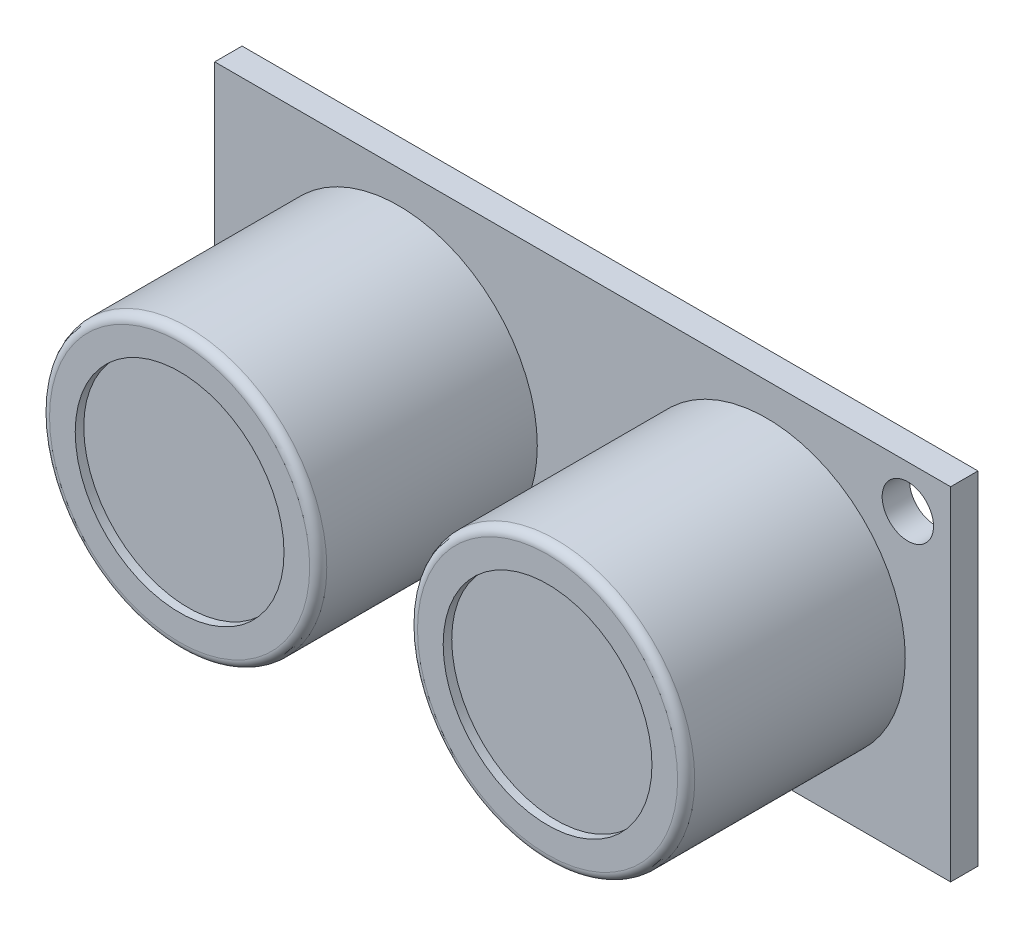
ISO-10303-21;
HEADER;
FILE_DESCRIPTION(('STEP AP214'),'2;1');
FILE_NAME('part.step','',(''),(''),'','','');
FILE_SCHEMA(('AUTOMOTIVE_DESIGN { 1 0 10303 214 1 1 1 1 }'));
ENDSEC;
DATA;
#1=APPLICATION_CONTEXT('core data for automotive mechanical design processes');
#2=APPLICATION_PROTOCOL_DEFINITION('international standard','automotive_design',2000,#1);
#3=PRODUCT_CONTEXT('',#1,'mechanical');
#4=PRODUCT('Part','Part','',(#3));
#5=PRODUCT_RELATED_PRODUCT_CATEGORY('part','',(#4));
#6=PRODUCT_DEFINITION_FORMATION('','',#4);
#7=PRODUCT_DEFINITION_CONTEXT('part definition',#1,'design');
#8=PRODUCT_DEFINITION('design','',#6,#7);
#9=PRODUCT_DEFINITION_SHAPE('','',#8);
#10=(LENGTH_UNIT() NAMED_UNIT(*) SI_UNIT(.MILLI.,.METRE.));
#11=(NAMED_UNIT(*) PLANE_ANGLE_UNIT() SI_UNIT($,.RADIAN.));
#12=(NAMED_UNIT(*) SI_UNIT($,.STERADIAN.) SOLID_ANGLE_UNIT());
#13=UNCERTAINTY_MEASURE_WITH_UNIT(LENGTH_MEASURE(1.E-05),#10,'distance_accuracy_value','');
#14=(GEOMETRIC_REPRESENTATION_CONTEXT(3) GLOBAL_UNCERTAINTY_ASSIGNED_CONTEXT((#13)) GLOBAL_UNIT_ASSIGNED_CONTEXT((#10,
#11,#12)) REPRESENTATION_CONTEXT('',''));
#15=CARTESIAN_POINT('',(0.,0.,0.));
#16=DIRECTION('',(0.,0.,1.));
#17=DIRECTION('',(1.,0.,0.));
#18=AXIS2_PLACEMENT_3D('',#15,#16,#17);
#19=CARTESIAN_POINT('',(10.75,10.,14.4));
#20=DIRECTION('',(0.,0.,1.));
#21=DIRECTION('',(-1.,0.,0.));
#22=AXIS2_PLACEMENT_3D('',#19,#20,#21);
#23=PLANE('',#22);
#24=CARTESIAN_POINT('',(10.75,10.,14.4));
#25=DIRECTION('',(0.,0.,1.));
#26=DIRECTION('',(1.,0.,0.));
#27=AXIS2_PLACEMENT_3D('',#24,#25,#26);
#28=CIRCLE('',#27,7.6);
#29=CARTESIAN_POINT('',(18.35,10.,14.4));
#30=VERTEX_POINT('',#29);
#31=EDGE_CURVE('E166',#30,#30,#28,.T.);
#32=ORIENTED_EDGE('',*,*,#31,.T.);
#33=EDGE_LOOP('',(#32));
#34=FACE_BOUND('',#33,.T.);
#35=CARTESIAN_POINT('',(10.75,10.,14.4));
#36=DIRECTION('',(0.,0.,-1.));
#37=DIRECTION('',(-1.,0.,0.));
#38=AXIS2_PLACEMENT_3D('',#35,#36,#37);
#39=CIRCLE('',#38,6.1);
#40=CARTESIAN_POINT('',(4.64999999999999,10.,14.4));
#41=VERTEX_POINT('',#40);
#42=EDGE_CURVE('E127',#41,#41,#39,.T.);
#43=ORIENTED_EDGE('',*,*,#42,.T.);
#44=EDGE_LOOP('',(#43));
#45=FACE_BOUND('',#44,.T.);
#46=ADVANCED_FACE('F33',(#34,#45),#23,.T.);
#47=CARTESIAN_POINT('',(0.,20.,1.6));
#48=DIRECTION('',(0.,0.,-1.));
#49=DIRECTION('',(-1.,0.,0.));
#50=AXIS2_PLACEMENT_3D('',#47,#48,#49);
#51=PLANE('',#50);
#52=CARTESIAN_POINT('',(10.75,10.,1.6));
#53=DIRECTION('',(0.,0.,-1.));
#54=DIRECTION('',(-1.,0.,0.));
#55=AXIS2_PLACEMENT_3D('',#52,#53,#54);
#56=CIRCLE('',#55,8.1);
#57=CARTESIAN_POINT('',(2.65,10.,1.6));
#58=VERTEX_POINT('',#57);
#59=EDGE_CURVE('E133',#58,#58,#56,.T.);
#60=ORIENTED_EDGE('',*,*,#59,.T.);
#61=EDGE_LOOP('',(#60));
#62=FACE_BOUND('',#61,.T.);
#63=CARTESIAN_POINT('',(40.5,17.5,1.6));
#64=DIRECTION('',(0.,0.,1.));
#65=DIRECTION('',(1.,0.,0.));
#66=AXIS2_PLACEMENT_3D('',#63,#64,#65);
#67=CIRCLE('',#66,1.5);
#68=CARTESIAN_POINT('',(42.,17.5,1.6));
#69=VERTEX_POINT('',#68);
#70=EDGE_CURVE('E145',#69,#69,#67,.T.);
#71=ORIENTED_EDGE('',*,*,#70,.F.);
#72=EDGE_LOOP('',(#71));
#73=FACE_BOUND('',#72,.T.);
#74=DIRECTION('',(0.,-1.,0.));
#75=VECTOR('',#74,1.);
#76=CARTESIAN_POINT('',(0.,0.,1.6));
#77=LINE('',#76,#75);
#78=CARTESIAN_POINT('',(0.,20.,1.6));
#79=VERTEX_POINT('',#78);
#80=CARTESIAN_POINT('',(0.,0.,1.6));
#81=VERTEX_POINT('',#80);
#82=EDGE_CURVE('E200',#79,#81,#77,.T.);
#83=ORIENTED_EDGE('',*,*,#82,.T.);
#84=DIRECTION('',(1.,0.,0.));
#85=VECTOR('',#84,1.);
#86=CARTESIAN_POINT('',(0.,0.,1.6));
#87=LINE('',#86,#85);
#88=CARTESIAN_POINT('',(43.,0.,1.6));
#89=VERTEX_POINT('',#88);
#90=EDGE_CURVE('E198',#81,#89,#87,.T.);
#91=ORIENTED_EDGE('',*,*,#90,.T.);
#92=DIRECTION('',(0.,1.,0.));
#93=VECTOR('',#92,1.);
#94=CARTESIAN_POINT('',(43.,0.,1.6));
#95=LINE('',#94,#93);
#96=CARTESIAN_POINT('',(43.,20.,1.6));
#97=VERTEX_POINT('',#96);
#98=EDGE_CURVE('E196',#89,#97,#95,.T.);
#99=ORIENTED_EDGE('',*,*,#98,.T.);
#100=DIRECTION('',(-1.,0.,0.));
#101=VECTOR('',#100,1.);
#102=CARTESIAN_POINT('',(0.,20.,1.6));
#103=LINE('',#102,#101);
#104=EDGE_CURVE('E194',#97,#79,#103,.T.);
#105=ORIENTED_EDGE('',*,*,#104,.T.);
#106=EDGE_LOOP('',(#83,#91,#99,#105));
#107=FACE_BOUND('',#106,.T.);
#108=CARTESIAN_POINT('',(2.5,2.5,1.6));
#109=DIRECTION('',(0.,0.,1.));
#110=DIRECTION('',(1.,0.,0.));
#111=AXIS2_PLACEMENT_3D('',#108,#109,#110);
#112=CIRCLE('',#111,1.5);
#113=CARTESIAN_POINT('',(4.,2.5,1.6));
#114=VERTEX_POINT('',#113);
#115=EDGE_CURVE('E151',#114,#114,#112,.T.);
#116=ORIENTED_EDGE('',*,*,#115,.F.);
#117=EDGE_LOOP('',(#116));
#118=FACE_BOUND('',#117,.T.);
#119=CARTESIAN_POINT('',(32.25,10.,1.6));
#120=DIRECTION('',(0.,0.,-1.));
#121=DIRECTION('',(-1.,0.,0.));
#122=AXIS2_PLACEMENT_3D('',#119,#120,#121);
#123=CIRCLE('',#122,8.1);
#124=CARTESIAN_POINT('',(24.15,10.,1.6));
#125=VERTEX_POINT('',#124);
#126=EDGE_CURVE('E179',#125,#125,#123,.F.);
#127=ORIENTED_EDGE('',*,*,#126,.F.);
#128=EDGE_LOOP('',(#127));
#129=FACE_BOUND('',#128,.T.);
#130=ADVANCED_FACE('F218',(#62,#73,#107,#118,#129),#51,.F.);
#131=CARTESIAN_POINT('',(0.,20.,0.));
#132=DIRECTION('',(0.,0.,-1.));
#133=DIRECTION('',(-1.,0.,0.));
#134=AXIS2_PLACEMENT_3D('',#131,#132,#133);
#135=PLANE('',#134);
#136=DIRECTION('',(0.,-1.,0.));
#137=VECTOR('',#136,1.);
#138=CARTESIAN_POINT('',(27.9,2.5,0.));
#139=LINE('',#138,#137);
#140=CARTESIAN_POINT('',(27.9,2.5,0.));
#141=VERTEX_POINT('',#140);
#142=CARTESIAN_POINT('',(27.9,0.,0.));
#143=VERTEX_POINT('',#142);
#144=EDGE_CURVE('E37',#141,#143,#139,.T.);
#145=ORIENTED_EDGE('',*,*,#144,.F.);
#146=DIRECTION('',(1.,0.,0.));
#147=VECTOR('',#146,1.);
#148=CARTESIAN_POINT('',(27.9,2.5,0.));
#149=LINE('',#148,#147);
#150=CARTESIAN_POINT('',(15.1,2.5,0.));
#151=VERTEX_POINT('',#150);
#152=EDGE_CURVE('E96',#151,#141,#149,.T.);
#153=ORIENTED_EDGE('',*,*,#152,.F.);
#154=DIRECTION('',(0.,1.,0.));
#155=VECTOR('',#154,1.);
#156=CARTESIAN_POINT('',(15.1,2.5,0.));
#157=LINE('',#156,#155);
#158=CARTESIAN_POINT('',(15.1,0.,0.));
#159=VERTEX_POINT('',#158);
#160=EDGE_CURVE('E100',#159,#151,#157,.T.);
#161=ORIENTED_EDGE('',*,*,#160,.F.);
#162=DIRECTION('',(1.,0.,0.));
#163=VECTOR('',#162,1.);
#164=CARTESIAN_POINT('',(0.,0.,0.));
#165=LINE('',#164,#163);
#166=CARTESIAN_POINT('',(0.,0.,0.));
#167=VERTEX_POINT('',#166);
#168=EDGE_CURVE('E164',#167,#159,#165,.T.);
#169=ORIENTED_EDGE('',*,*,#168,.F.);
#170=DIRECTION('',(0.,-1.,0.));
#171=VECTOR('',#170,1.);
#172=CARTESIAN_POINT('',(0.,0.,0.));
#173=LINE('',#172,#171);
#174=CARTESIAN_POINT('',(0.,20.,0.));
#175=VERTEX_POINT('',#174);
#176=EDGE_CURVE('E154',#175,#167,#173,.T.);
#177=ORIENTED_EDGE('',*,*,#176,.F.);
#178=DIRECTION('',(-1.,0.,0.));
#179=VECTOR('',#178,1.);
#180=CARTESIAN_POINT('',(0.,20.,0.));
#181=LINE('',#180,#179);
#182=CARTESIAN_POINT('',(43.,20.,0.));
#183=VERTEX_POINT('',#182);
#184=EDGE_CURVE('E202',#183,#175,#181,.T.);
#185=ORIENTED_EDGE('',*,*,#184,.F.);
#186=DIRECTION('',(0.,1.,0.));
#187=VECTOR('',#186,1.);
#188=CARTESIAN_POINT('',(43.,0.,0.));
#189=LINE('',#188,#187);
#190=CARTESIAN_POINT('',(43.,0.,0.));
#191=VERTEX_POINT('',#190);
#192=EDGE_CURVE('E159',#191,#183,#189,.T.);
#193=ORIENTED_EDGE('',*,*,#192,.F.);
#194=EDGE_CURVE('E55',#143,#191,#165,.T.);
#195=ORIENTED_EDGE('',*,*,#194,.F.);
#196=EDGE_LOOP('',(#145,#153,#161,#169,#177,#185,#193,#195));
#197=FACE_BOUND('',#196,.T.);
#198=CARTESIAN_POINT('',(2.5,2.5,0.));
#199=DIRECTION('',(0.,0.,1.));
#200=DIRECTION('',(1.,0.,0.));
#201=AXIS2_PLACEMENT_3D('',#198,#199,#200);
#202=CIRCLE('',#201,1.5);
#203=CARTESIAN_POINT('',(4.,2.5,0.));
#204=VERTEX_POINT('',#203);
#205=EDGE_CURVE('E148',#204,#204,#202,.T.);
#206=ORIENTED_EDGE('',*,*,#205,.T.);
#207=EDGE_LOOP('',(#206));
#208=FACE_BOUND('',#207,.T.);
#209=CARTESIAN_POINT('',(40.5,17.5,0.));
#210=DIRECTION('',(0.,0.,1.));
#211=DIRECTION('',(1.,0.,0.));
#212=AXIS2_PLACEMENT_3D('',#209,#210,#211);
#213=CIRCLE('',#212,1.5);
#214=CARTESIAN_POINT('',(42.,17.5,0.));
#215=VERTEX_POINT('',#214);
#216=EDGE_CURVE('E142',#215,#215,#213,.T.);
#217=ORIENTED_EDGE('',*,*,#216,.T.);
#218=EDGE_LOOP('',(#217));
#219=FACE_BOUND('',#218,.T.);
#220=ADVANCED_FACE('F98',(#197,#208,#219),#135,.T.);
#221=CARTESIAN_POINT('',(0.,0.,1.6));
#222=DIRECTION('',(1.,0.,0.));
#223=DIRECTION('',(0.,0.,-1.));
#224=AXIS2_PLACEMENT_3D('',#221,#222,#223);
#225=PLANE('',#224);
#226=ORIENTED_EDGE('',*,*,#176,.T.);
#227=DIRECTION('',(0.,0.,-1.));
#228=VECTOR('',#227,1.);
#229=CARTESIAN_POINT('',(0.,0.,1.6));
#230=LINE('',#229,#228);
#231=EDGE_CURVE('E182',#81,#167,#230,.T.);
#232=ORIENTED_EDGE('',*,*,#231,.F.);
#233=ORIENTED_EDGE('',*,*,#82,.F.);
#234=DIRECTION('',(0.,0.,-1.));
#235=VECTOR('',#234,1.);
#236=CARTESIAN_POINT('',(0.,20.,1.6));
#237=LINE('',#236,#235);
#238=EDGE_CURVE('E191',#79,#175,#237,.T.);
#239=ORIENTED_EDGE('',*,*,#238,.T.);
#240=EDGE_LOOP('',(#226,#232,#233,#239));
#241=FACE_BOUND('',#240,.T.);
#242=ADVANCED_FACE('F35',(#241),#225,.F.);
#243=CARTESIAN_POINT('',(0.,0.,1.6));
#244=DIRECTION('',(0.,1.,0.));
#245=DIRECTION('',(0.,0.,1.));
#246=AXIS2_PLACEMENT_3D('',#243,#244,#245);
#247=PLANE('',#246);
#248=ORIENTED_EDGE('',*,*,#168,.T.);
#249=DIRECTION('',(0.,0.,1.));
#250=VECTOR('',#249,1.);
#251=CARTESIAN_POINT('',(15.1,0.,-2.5));
#252=LINE('',#251,#250);
#253=CARTESIAN_POINT('',(15.1,0.,-2.5));
#254=VERTEX_POINT('',#253);
#255=EDGE_CURVE('E116',#254,#159,#252,.T.);
#256=ORIENTED_EDGE('',*,*,#255,.F.);
#257=DIRECTION('',(-1.,0.,0.));
#258=VECTOR('',#257,1.);
#259=CARTESIAN_POINT('',(27.9,0.,-2.5));
#260=LINE('',#259,#258);
#261=CARTESIAN_POINT('',(27.9,0.,-2.5));
#262=VERTEX_POINT('',#261);
#263=EDGE_CURVE('E223',#262,#254,#260,.T.);
#264=ORIENTED_EDGE('',*,*,#263,.F.);
#265=DIRECTION('',(0.,0.,1.));
#266=VECTOR('',#265,1.);
#267=CARTESIAN_POINT('',(27.9,0.,-2.5));
#268=LINE('',#267,#266);
#269=EDGE_CURVE('E122',#262,#143,#268,.T.);
#270=ORIENTED_EDGE('',*,*,#269,.T.);
#271=ORIENTED_EDGE('',*,*,#194,.T.);
#272=DIRECTION('',(0.,0.,-1.));
#273=VECTOR('',#272,1.);
#274=CARTESIAN_POINT('',(43.,0.,1.6));
#275=LINE('',#274,#273);
#276=EDGE_CURVE('E185',#89,#191,#275,.T.);
#277=ORIENTED_EDGE('',*,*,#276,.F.);
#278=ORIENTED_EDGE('',*,*,#90,.F.);
#279=ORIENTED_EDGE('',*,*,#231,.T.);
#280=EDGE_LOOP('',(#248,#256,#264,#270,#271,#277,#278,#279));
#281=FACE_BOUND('',#280,.T.);
#282=ADVANCED_FACE('F221',(#281),#247,.F.);
#283=CARTESIAN_POINT('',(43.,0.,1.6));
#284=DIRECTION('',(-1.,0.,0.));
#285=DIRECTION('',(0.,0.,1.));
#286=AXIS2_PLACEMENT_3D('',#283,#284,#285);
#287=PLANE('',#286);
#288=ORIENTED_EDGE('',*,*,#192,.T.);
#289=DIRECTION('',(0.,0.,-1.));
#290=VECTOR('',#289,1.);
#291=CARTESIAN_POINT('',(43.,20.,1.6));
#292=LINE('',#291,#290);
#293=EDGE_CURVE('E188',#97,#183,#292,.T.);
#294=ORIENTED_EDGE('',*,*,#293,.F.);
#295=ORIENTED_EDGE('',*,*,#98,.F.);
#296=ORIENTED_EDGE('',*,*,#276,.T.);
#297=EDGE_LOOP('',(#288,#294,#295,#296));
#298=FACE_BOUND('',#297,.T.);
#299=ADVANCED_FACE('F208',(#298),#287,.F.);
#300=CARTESIAN_POINT('',(0.,20.,1.6));
#301=DIRECTION('',(0.,-1.,0.));
#302=DIRECTION('',(0.,0.,-1.));
#303=AXIS2_PLACEMENT_3D('',#300,#301,#302);
#304=PLANE('',#303);
#305=ORIENTED_EDGE('',*,*,#184,.T.);
#306=ORIENTED_EDGE('',*,*,#238,.F.);
#307=ORIENTED_EDGE('',*,*,#104,.F.);
#308=ORIENTED_EDGE('',*,*,#293,.T.);
#309=EDGE_LOOP('',(#305,#306,#307,#308));
#310=FACE_BOUND('',#309,.T.);
#311=ADVANCED_FACE('F212',(#310),#304,.F.);
#312=CARTESIAN_POINT('',(2.5,2.5,1.6));
#313=DIRECTION('',(0.,0.,-1.));
#314=DIRECTION('',(-1.,0.,0.));
#315=AXIS2_PLACEMENT_3D('',#312,#313,#314);
#316=CYLINDRICAL_SURFACE('',#315,1.5);
#317=ORIENTED_EDGE('',*,*,#115,.T.);
#318=EDGE_LOOP('',(#317));
#319=FACE_BOUND('',#318,.T.);
#320=ORIENTED_EDGE('',*,*,#205,.F.);
#321=EDGE_LOOP('',(#320));
#322=FACE_BOUND('',#321,.T.);
#323=ADVANCED_FACE('F300',(#319,#322),#316,.F.);
#324=CARTESIAN_POINT('',(40.5,17.5,1.6));
#325=DIRECTION('',(0.,0.,-1.));
#326=DIRECTION('',(-1.,0.,0.));
#327=AXIS2_PLACEMENT_3D('',#324,#325,#326);
#328=CYLINDRICAL_SURFACE('',#327,1.5);
#329=ORIENTED_EDGE('',*,*,#70,.T.);
#330=EDGE_LOOP('',(#329));
#331=FACE_BOUND('',#330,.T.);
#332=ORIENTED_EDGE('',*,*,#216,.F.);
#333=EDGE_LOOP('',(#332));
#334=FACE_BOUND('',#333,.T.);
#335=ADVANCED_FACE('F296',(#331,#334),#328,.F.);
#336=CARTESIAN_POINT('',(32.25,10.,14.4));
#337=DIRECTION('',(0.,0.,-1.));
#338=DIRECTION('',(-1.,0.,0.));
#339=AXIS2_PLACEMENT_3D('',#336,#337,#338);
#340=CYLINDRICAL_SURFACE('',#339,8.1);
#341=CARTESIAN_POINT('',(32.25,10.,13.9));
#342=DIRECTION('',(0.,0.,1.));
#343=DIRECTION('',(1.,0.,0.));
#344=AXIS2_PLACEMENT_3D('',#341,#342,#343);
#345=CIRCLE('',#344,8.1);
#346=CARTESIAN_POINT('',(40.35,10.,13.9));
#347=VERTEX_POINT('',#346);
#348=EDGE_CURVE('E173',#347,#347,#345,.F.);
#349=ORIENTED_EDGE('',*,*,#348,.T.);
#350=EDGE_LOOP('',(#349));
#351=FACE_BOUND('',#350,.T.);
#352=ORIENTED_EDGE('',*,*,#126,.T.);
#353=EDGE_LOOP('',(#352));
#354=FACE_BOUND('',#353,.T.);
#355=ADVANCED_FACE('F292',(#351,#354),#340,.T.);
#356=CARTESIAN_POINT('',(32.25,10.,14.4));
#357=DIRECTION('',(0.,0.,1.));
#358=DIRECTION('',(1.,0.,0.));
#359=AXIS2_PLACEMENT_3D('',#356,#357,#358);
#360=PLANE('',#359);
#361=CARTESIAN_POINT('',(32.25,10.,14.4));
#362=DIRECTION('',(0.,0.,1.));
#363=DIRECTION('',(1.,0.,0.));
#364=AXIS2_PLACEMENT_3D('',#361,#362,#363);
#365=CIRCLE('',#364,7.6);
#366=CARTESIAN_POINT('',(39.85,10.,14.4));
#367=VERTEX_POINT('',#366);
#368=EDGE_CURVE('E176',#367,#367,#365,.T.);
#369=ORIENTED_EDGE('',*,*,#368,.T.);
#370=EDGE_LOOP('',(#369));
#371=FACE_BOUND('',#370,.T.);
#372=CARTESIAN_POINT('',(32.25,10.,14.4));
#373=DIRECTION('',(0.,0.,1.));
#374=DIRECTION('',(1.,0.,0.));
#375=AXIS2_PLACEMENT_3D('',#372,#373,#374);
#376=CIRCLE('',#375,6.1);
#377=CARTESIAN_POINT('',(38.35,10.,14.4));
#378=VERTEX_POINT('',#377);
#379=EDGE_CURVE('E136',#378,#378,#376,.T.);
#380=ORIENTED_EDGE('',*,*,#379,.F.);
#381=EDGE_LOOP('',(#380));
#382=FACE_BOUND('',#381,.T.);
#383=ADVANCED_FACE('F288',(#371,#382),#360,.T.);
#384=CARTESIAN_POINT('',(32.25,10.,13.9));
#385=DIRECTION('',(0.,0.,1.));
#386=DIRECTION('',(1.,0.,0.));
#387=AXIS2_PLACEMENT_3D('',#384,#385,#386);
#388=CYLINDRICAL_SURFACE('',#387,6.1);
#389=CARTESIAN_POINT('',(32.25,10.,13.9));
#390=DIRECTION('',(0.,0.,1.));
#391=DIRECTION('',(1.,0.,0.));
#392=AXIS2_PLACEMENT_3D('',#389,#390,#391);
#393=CIRCLE('',#392,6.1);
#394=CARTESIAN_POINT('',(38.35,10.,13.9));
#395=VERTEX_POINT('',#394);
#396=EDGE_CURVE('E139',#395,#395,#393,.T.);
#397=ORIENTED_EDGE('',*,*,#396,.F.);
#398=EDGE_LOOP('',(#397));
#399=FACE_BOUND('',#398,.T.);
#400=ORIENTED_EDGE('',*,*,#379,.T.);
#401=EDGE_LOOP('',(#400));
#402=FACE_BOUND('',#401,.T.);
#403=ADVANCED_FACE('F284',(#399,#402),#388,.F.);
#404=CARTESIAN_POINT('',(32.25,10.,13.9));
#405=DIRECTION('',(0.,0.,1.));
#406=DIRECTION('',(1.,0.,0.));
#407=AXIS2_PLACEMENT_3D('',#404,#405,#406);
#408=PLANE('',#407);
#409=ORIENTED_EDGE('',*,*,#396,.T.);
#410=EDGE_LOOP('',(#409));
#411=FACE_BOUND('',#410,.T.);
#412=ADVANCED_FACE('F280',(#411),#408,.T.);
#413=CARTESIAN_POINT('',(32.25,10.,13.9));
#414=DIRECTION('',(0.,0.,1.));
#415=DIRECTION('',(1.,0.,0.));
#416=AXIS2_PLACEMENT_3D('',#413,#414,#415);
#417=TOROIDAL_SURFACE('',#416,7.6,0.5);
#418=ORIENTED_EDGE('',*,*,#348,.F.);
#419=EDGE_LOOP('',(#418));
#420=FACE_BOUND('',#419,.T.);
#421=ORIENTED_EDGE('',*,*,#368,.F.);
#422=EDGE_LOOP('',(#421));
#423=FACE_BOUND('',#422,.T.);
#424=ADVANCED_FACE('F276',(#420,#423),#417,.T.);
#425=CARTESIAN_POINT('',(10.75,10.,14.4));
#426=DIRECTION('',(0.,0.,-1.));
#427=DIRECTION('',(-1.,0.,0.));
#428=AXIS2_PLACEMENT_3D('',#425,#426,#427);
#429=CYLINDRICAL_SURFACE('',#428,8.1);
#430=CARTESIAN_POINT('',(10.75,10.,13.9));
#431=DIRECTION('',(0.,0.,1.));
#432=DIRECTION('',(1.,0.,0.));
#433=AXIS2_PLACEMENT_3D('',#430,#431,#432);
#434=CIRCLE('',#433,8.1);
#435=CARTESIAN_POINT('',(18.85,10.,13.9));
#436=VERTEX_POINT('',#435);
#437=EDGE_CURVE('E170',#436,#436,#434,.F.);
#438=ORIENTED_EDGE('',*,*,#437,.T.);
#439=EDGE_LOOP('',(#438));
#440=FACE_BOUND('',#439,.T.);
#441=ORIENTED_EDGE('',*,*,#59,.F.);
#442=EDGE_LOOP('',(#441));
#443=FACE_BOUND('',#442,.T.);
#444=ADVANCED_FACE('F273',(#440,#443),#429,.T.);
#445=CARTESIAN_POINT('',(10.75,10.,13.9));
#446=DIRECTION('',(0.,0.,1.));
#447=DIRECTION('',(1.,0.,0.));
#448=AXIS2_PLACEMENT_3D('',#445,#446,#447);
#449=CYLINDRICAL_SURFACE('',#448,6.1);
#450=CARTESIAN_POINT('',(10.75,10.,13.9));
#451=DIRECTION('',(0.,0.,-1.));
#452=DIRECTION('',(-1.,0.,0.));
#453=AXIS2_PLACEMENT_3D('',#450,#451,#452);
#454=CIRCLE('',#453,6.1);
#455=CARTESIAN_POINT('',(4.64999999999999,10.,13.9));
#456=VERTEX_POINT('',#455);
#457=EDGE_CURVE('E130',#456,#456,#454,.T.);
#458=ORIENTED_EDGE('',*,*,#457,.T.);
#459=EDGE_LOOP('',(#458));
#460=FACE_BOUND('',#459,.T.);
#461=ORIENTED_EDGE('',*,*,#42,.F.);
#462=EDGE_LOOP('',(#461));
#463=FACE_BOUND('',#462,.T.);
#464=ADVANCED_FACE('F271',(#460,#463),#449,.F.);
#465=CARTESIAN_POINT('',(10.75,10.,13.9));
#466=DIRECTION('',(0.,0.,1.));
#467=DIRECTION('',(-1.,0.,0.));
#468=AXIS2_PLACEMENT_3D('',#465,#466,#467);
#469=PLANE('',#468);
#470=ORIENTED_EDGE('',*,*,#457,.F.);
#471=EDGE_LOOP('',(#470));
#472=FACE_BOUND('',#471,.T.);
#473=ADVANCED_FACE('F347',(#472),#469,.T.);
#474=CARTESIAN_POINT('',(10.75,10.,13.9));
#475=DIRECTION('',(0.,0.,1.));
#476=DIRECTION('',(1.,0.,0.));
#477=AXIS2_PLACEMENT_3D('',#474,#475,#476);
#478=TOROIDAL_SURFACE('',#477,7.6,0.5);
#479=ORIENTED_EDGE('',*,*,#31,.F.);
#480=EDGE_LOOP('',(#479));
#481=FACE_BOUND('',#480,.T.);
#482=ORIENTED_EDGE('',*,*,#437,.F.);
#483=EDGE_LOOP('',(#482));
#484=FACE_BOUND('',#483,.T.);
#485=ADVANCED_FACE('F355',(#481,#484),#478,.T.);
#486=CARTESIAN_POINT('',(27.9,2.5,-2.5));
#487=DIRECTION('',(-1.,0.,0.));
#488=DIRECTION('',(0.,0.,1.));
#489=AXIS2_PLACEMENT_3D('',#486,#487,#488);
#490=PLANE('',#489);
#491=ORIENTED_EDGE('',*,*,#144,.T.);
#492=ORIENTED_EDGE('',*,*,#269,.F.);
#493=DIRECTION('',(0.,-1.,0.));
#494=VECTOR('',#493,1.);
#495=CARTESIAN_POINT('',(27.9,2.5,-2.5));
#496=LINE('',#495,#494);
#497=CARTESIAN_POINT('',(27.9,2.5,-2.5));
#498=VERTEX_POINT('',#497);
#499=EDGE_CURVE('E106',#498,#262,#496,.T.);
#500=ORIENTED_EDGE('',*,*,#499,.F.);
#501=DIRECTION('',(0.,0.,1.));
#502=VECTOR('',#501,1.);
#503=CARTESIAN_POINT('',(27.9,2.5,-2.5));
#504=LINE('',#503,#502);
#505=EDGE_CURVE('E120',#498,#141,#504,.T.);
#506=ORIENTED_EDGE('',*,*,#505,.T.);
#507=EDGE_LOOP('',(#491,#492,#500,#506));
#508=FACE_BOUND('',#507,.T.);
#509=ADVANCED_FACE('F228',(#508),#490,.F.);
#510=CARTESIAN_POINT('',(15.1,2.5,-2.5));
#511=DIRECTION('',(1.,0.,0.));
#512=DIRECTION('',(0.,0.,-1.));
#513=AXIS2_PLACEMENT_3D('',#510,#511,#512);
#514=PLANE('',#513);
#515=ORIENTED_EDGE('',*,*,#160,.T.);
#516=DIRECTION('',(0.,0.,1.));
#517=VECTOR('',#516,1.);
#518=CARTESIAN_POINT('',(15.1,2.5,-2.5));
#519=LINE('',#518,#517);
#520=CARTESIAN_POINT('',(15.1,2.5,-2.5));
#521=VERTEX_POINT('',#520);
#522=EDGE_CURVE('E113',#521,#151,#519,.T.);
#523=ORIENTED_EDGE('',*,*,#522,.F.);
#524=DIRECTION('',(0.,1.,0.));
#525=VECTOR('',#524,1.);
#526=CARTESIAN_POINT('',(15.1,2.5,-2.5));
#527=LINE('',#526,#525);
#528=EDGE_CURVE('E243',#254,#521,#527,.T.);
#529=ORIENTED_EDGE('',*,*,#528,.F.);
#530=ORIENTED_EDGE('',*,*,#255,.T.);
#531=EDGE_LOOP('',(#515,#523,#529,#530));
#532=FACE_BOUND('',#531,.T.);
#533=ADVANCED_FACE('F111',(#532),#514,.F.);
#534=CARTESIAN_POINT('',(27.9,2.5,-2.5));
#535=DIRECTION('',(0.,-1.,0.));
#536=DIRECTION('',(0.,0.,-1.));
#537=AXIS2_PLACEMENT_3D('',#534,#535,#536);
#538=PLANE('',#537);
#539=ORIENTED_EDGE('',*,*,#152,.T.);
#540=ORIENTED_EDGE('',*,*,#505,.F.);
#541=DIRECTION('',(1.,0.,0.));
#542=VECTOR('',#541,1.);
#543=CARTESIAN_POINT('',(27.9,2.5,-2.5));
#544=LINE('',#543,#542);
#545=EDGE_CURVE('E119',#521,#498,#544,.T.);
#546=ORIENTED_EDGE('',*,*,#545,.F.);
#547=ORIENTED_EDGE('',*,*,#522,.T.);
#548=EDGE_LOOP('',(#539,#540,#546,#547));
#549=FACE_BOUND('',#548,.T.);
#550=ADVANCED_FACE('F118',(#549),#538,.F.);
#551=CARTESIAN_POINT('',(27.9,0.,-2.5));
#552=DIRECTION('',(0.,0.,-1.));
#553=DIRECTION('',(-1.,0.,0.));
#554=AXIS2_PLACEMENT_3D('',#551,#552,#553);
#555=PLANE('',#554);
#556=CARTESIAN_POINT('',(24.04,1.25,-2.5));
#557=DIRECTION('',(0.,0.,-1.));
#558=DIRECTION('',(1.,0.,0.));
#559=AXIS2_PLACEMENT_3D('',#556,#557,#558);
#560=CIRCLE('',#559,0.3);
#561=CARTESIAN_POINT('',(24.34,1.25,-2.5));
#562=VERTEX_POINT('',#561);
#563=EDGE_CURVE('E11',#562,#562,#560,.T.);
#564=ORIENTED_EDGE('',*,*,#563,.F.);
#565=EDGE_LOOP('',(#564));
#566=FACE_BOUND('',#565,.T.);
#567=CARTESIAN_POINT('',(16.42,1.25,-2.5));
#568=DIRECTION('',(0.,0.,-1.));
#569=DIRECTION('',(-1.,0.,0.));
#570=AXIS2_PLACEMENT_3D('',#567,#568,#569);
#571=CIRCLE('',#570,0.3);
#572=CARTESIAN_POINT('',(16.12,1.25,-2.5));
#573=VERTEX_POINT('',#572);
#574=EDGE_CURVE('E43',#573,#573,#571,.T.);
#575=ORIENTED_EDGE('',*,*,#574,.F.);
#576=EDGE_LOOP('',(#575));
#577=FACE_BOUND('',#576,.T.);
#578=CARTESIAN_POINT('',(18.96,1.25,-2.5));
#579=DIRECTION('',(0.,0.,-1.));
#580=DIRECTION('',(-1.,0.,0.));
#581=AXIS2_PLACEMENT_3D('',#578,#579,#580);
#582=CIRCLE('',#581,0.3);
#583=CARTESIAN_POINT('',(18.66,1.25,-2.5));
#584=VERTEX_POINT('',#583);
#585=EDGE_CURVE('E601',#584,#584,#582,.T.);
#586=ORIENTED_EDGE('',*,*,#585,.F.);
#587=EDGE_LOOP('',(#586));
#588=FACE_BOUND('',#587,.T.);
#589=CARTESIAN_POINT('',(26.58,1.25,-2.5));
#590=DIRECTION('',(0.,0.,-1.));
#591=DIRECTION('',(1.,0.,0.));
#592=AXIS2_PLACEMENT_3D('',#589,#590,#591);
#593=CIRCLE('',#592,0.3);
#594=CARTESIAN_POINT('',(26.88,1.25,-2.5));
#595=VERTEX_POINT('',#594);
#596=EDGE_CURVE('E611',#595,#595,#593,.T.);
#597=ORIENTED_EDGE('',*,*,#596,.F.);
#598=EDGE_LOOP('',(#597));
#599=FACE_BOUND('',#598,.T.);
#600=CARTESIAN_POINT('',(21.5,1.25,-2.5));
#601=DIRECTION('',(0.,0.,-1.));
#602=DIRECTION('',(-1.,0.,0.));
#603=AXIS2_PLACEMENT_3D('',#600,#601,#602);
#604=CIRCLE('',#603,0.3);
#605=CARTESIAN_POINT('',(21.2,1.25,-2.5));
#606=VERTEX_POINT('',#605);
#607=EDGE_CURVE('E169',#606,#606,#604,.T.);
#608=ORIENTED_EDGE('',*,*,#607,.F.);
#609=EDGE_LOOP('',(#608));
#610=FACE_BOUND('',#609,.T.);
#611=ORIENTED_EDGE('',*,*,#499,.T.);
#612=ORIENTED_EDGE('',*,*,#263,.T.);
#613=ORIENTED_EDGE('',*,*,#528,.T.);
#614=ORIENTED_EDGE('',*,*,#545,.T.);
#615=EDGE_LOOP('',(#611,#612,#613,#614));
#616=FACE_BOUND('',#615,.T.);
#617=ADVANCED_FACE('F245',(#566,#577,#588,#599,#610,#616),#555,.T.);
#618=CARTESIAN_POINT('',(21.5,0.749999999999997,-5.5));
#619=DIRECTION('',(0.,-1.,0.));
#620=DIRECTION('',(0.,0.,-1.));
#621=AXIS2_PLACEMENT_3D('',#618,#619,#620);
#622=CYLINDRICAL_SURFACE('',#621,0.3);
#623=CARTESIAN_POINT('',(21.5,0.749999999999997,-5.5));
#624=DIRECTION('',(0.,-1.,0.));
#625=DIRECTION('',(-1.,0.,0.));
#626=AXIS2_PLACEMENT_3D('',#623,#624,#625);
#627=CIRCLE('',#626,0.3);
#628=CARTESIAN_POINT('',(21.5,0.749999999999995,-5.8));
#629=VERTEX_POINT('',#628);
#630=EDGE_CURVE('E231',#629,#629,#627,.T.);
#631=ORIENTED_EDGE('',*,*,#630,.T.);
#632=EDGE_LOOP('',(#631));
#633=FACE_BOUND('',#632,.T.);
#634=CARTESIAN_POINT('',(21.5,-2.,-5.5));
#635=DIRECTION('',(0.,-1.,0.));
#636=DIRECTION('',(-1.,0.,0.));
#637=AXIS2_PLACEMENT_3D('',#634,#635,#636);
#638=CIRCLE('',#637,0.3);
#639=CARTESIAN_POINT('',(21.2,-2.,-5.5));
#640=VERTEX_POINT('',#639);
#641=EDGE_CURVE('E229',#640,#640,#638,.T.);
#642=ORIENTED_EDGE('',*,*,#641,.F.);
#643=EDGE_LOOP('',(#642));
#644=FACE_BOUND('',#643,.T.);
#645=ADVANCED_FACE('F247',(#633,#644),#622,.T.);
#646=CARTESIAN_POINT('',(21.5,0.75,-5.));
#647=DIRECTION('',(-1.,0.,0.));
#648=DIRECTION('',(0.,0.,1.));
#649=AXIS2_PLACEMENT_3D('',#646,#647,#648);
#650=TOROIDAL_SURFACE('',#649,0.5,0.3);
#651=CARTESIAN_POINT('',(21.5,1.25,-5.));
#652=DIRECTION('',(0.,0.,-1.));
#653=DIRECTION('',(-1.,0.,0.));
#654=AXIS2_PLACEMENT_3D('',#651,#652,#653);
#655=CIRCLE('',#654,0.3);
#656=CARTESIAN_POINT('',(21.5,1.55,-4.99999999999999));
#657=VERTEX_POINT('',#656);
#658=EDGE_CURVE('E236',#657,#657,#655,.T.);
#659=CARTESIAN_POINT('',(21.5,0.75,-5.));
#660=DIRECTION('',(-1.,0.,0.));
#661=DIRECTION('',(0.,0.,1.));
#662=AXIS2_PLACEMENT_3D('',#659,#660,#661);
#663=CIRCLE('',#662,0.8);
#664=EDGE_CURVE('',#657,#629,#663,.T.);
#665=ORIENTED_EDGE('',*,*,#658,.T.);
#666=ORIENTED_EDGE('',*,*,#630,.F.);
#667=ORIENTED_EDGE('',*,*,#664,.T.);
#668=ORIENTED_EDGE('',*,*,#664,.F.);
#669=EDGE_LOOP('',(#665,#667,#666,#668));
#670=FACE_BOUND('',#669,.T.);
#671=ADVANCED_FACE('F254',(#670),#650,.T.);
#672=CARTESIAN_POINT('',(21.5,1.25,-5.));
#673=DIRECTION('',(0.,0.,1.));
#674=DIRECTION('',(1.,0.,0.));
#675=AXIS2_PLACEMENT_3D('',#672,#673,#674);
#676=CYLINDRICAL_SURFACE('',#675,0.3);
#677=ORIENTED_EDGE('',*,*,#658,.F.);
#678=EDGE_LOOP('',(#677));
#679=FACE_BOUND('',#678,.T.);
#680=ORIENTED_EDGE('',*,*,#607,.T.);
#681=EDGE_LOOP('',(#680));
#682=FACE_BOUND('',#681,.T.);
#683=ADVANCED_FACE('F402',(#679,#682),#676,.T.);
#684=CARTESIAN_POINT('',(21.5,-2.,-5.5));
#685=DIRECTION('',(0.,-1.,0.));
#686=DIRECTION('',(-1.,0.,0.));
#687=AXIS2_PLACEMENT_3D('',#684,#685,#686);
#688=PLANE('',#687);
#689=ORIENTED_EDGE('',*,*,#641,.T.);
#690=EDGE_LOOP('',(#689));
#691=FACE_BOUND('',#690,.T.);
#692=ADVANCED_FACE('F412',(#691),#688,.T.);
#693=CARTESIAN_POINT('',(26.58,0.749999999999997,-5.5));
#694=DIRECTION('',(0.,-1.,0.));
#695=DIRECTION('',(0.,0.,-1.));
#696=AXIS2_PLACEMENT_3D('',#693,#694,#695);
#697=CYLINDRICAL_SURFACE('',#696,0.3);
#698=CARTESIAN_POINT('',(26.58,0.749999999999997,-5.5));
#699=DIRECTION('',(0.,-1.,0.));
#700=DIRECTION('',(1.,0.,0.));
#701=AXIS2_PLACEMENT_3D('',#698,#699,#700);
#702=CIRCLE('',#701,0.3);
#703=CARTESIAN_POINT('',(26.58,0.749999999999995,-5.8));
#704=VERTEX_POINT('',#703);
#705=EDGE_CURVE('E625',#704,#704,#702,.T.);
#706=ORIENTED_EDGE('',*,*,#705,.T.);
#707=EDGE_LOOP('',(#706));
#708=FACE_BOUND('',#707,.T.);
#709=CARTESIAN_POINT('',(26.58,-2.,-5.5));
#710=DIRECTION('',(0.,-1.,0.));
#711=DIRECTION('',(1.,0.,0.));
#712=AXIS2_PLACEMENT_3D('',#709,#710,#711);
#713=CIRCLE('',#712,0.3);
#714=CARTESIAN_POINT('',(26.88,-2.,-5.5));
#715=VERTEX_POINT('',#714);
#716=EDGE_CURVE('E628',#715,#715,#713,.T.);
#717=ORIENTED_EDGE('',*,*,#716,.F.);
#718=EDGE_LOOP('',(#717));
#719=FACE_BOUND('',#718,.T.);
#720=ADVANCED_FACE('F422',(#708,#719),#697,.T.);
#721=CARTESIAN_POINT('',(26.58,0.75,-5.));
#722=DIRECTION('',(-1.,0.,0.));
#723=DIRECTION('',(0.,0.,1.));
#724=AXIS2_PLACEMENT_3D('',#721,#722,#723);
#725=TOROIDAL_SURFACE('',#724,0.5,0.3);
#726=CARTESIAN_POINT('',(26.58,1.25,-5.));
#727=DIRECTION('',(0.,0.,-1.));
#728=DIRECTION('',(1.,0.,0.));
#729=AXIS2_PLACEMENT_3D('',#726,#727,#728);
#730=CIRCLE('',#729,0.3);
#731=CARTESIAN_POINT('',(26.58,1.55,-4.99999999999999));
#732=VERTEX_POINT('',#731);
#733=EDGE_CURVE('E620',#732,#732,#730,.T.);
#734=CARTESIAN_POINT('',(26.58,0.75,-5.));
#735=DIRECTION('',(-1.,0.,0.));
#736=DIRECTION('',(0.,0.,1.));
#737=AXIS2_PLACEMENT_3D('',#734,#735,#736);
#738=CIRCLE('',#737,0.8);
#739=EDGE_CURVE('',#732,#704,#738,.T.);
#740=ORIENTED_EDGE('',*,*,#733,.T.);
#741=ORIENTED_EDGE('',*,*,#705,.F.);
#742=ORIENTED_EDGE('',*,*,#739,.T.);
#743=ORIENTED_EDGE('',*,*,#739,.F.);
#744=EDGE_LOOP('',(#740,#742,#741,#743));
#745=FACE_BOUND('',#744,.T.);
#746=ADVANCED_FACE('F431',(#745),#725,.T.);
#747=CARTESIAN_POINT('',(26.58,1.25,-5.));
#748=DIRECTION('',(0.,0.,1.));
#749=DIRECTION('',(1.,0.,0.));
#750=AXIS2_PLACEMENT_3D('',#747,#748,#749);
#751=CYLINDRICAL_SURFACE('',#750,0.3);
#752=ORIENTED_EDGE('',*,*,#733,.F.);
#753=EDGE_LOOP('',(#752));
#754=FACE_BOUND('',#753,.T.);
#755=ORIENTED_EDGE('',*,*,#596,.T.);
#756=EDGE_LOOP('',(#755));
#757=FACE_BOUND('',#756,.T.);
#758=ADVANCED_FACE('F441',(#754,#757),#751,.T.);
#759=CARTESIAN_POINT('',(26.58,-2.,-5.5));
#760=DIRECTION('',(0.,1.,0.));
#761=DIRECTION('',(1.,0.,0.));
#762=AXIS2_PLACEMENT_3D('',#759,#760,#761);
#763=PLANE('',#762);
#764=ORIENTED_EDGE('',*,*,#716,.T.);
#765=EDGE_LOOP('',(#764));
#766=FACE_BOUND('',#765,.T.);
#767=ADVANCED_FACE('F451',(#766),#763,.F.);
#768=CARTESIAN_POINT('',(18.96,0.749999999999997,-5.5));
#769=DIRECTION('',(0.,-1.,0.));
#770=DIRECTION('',(0.,0.,-1.));
#771=AXIS2_PLACEMENT_3D('',#768,#769,#770);
#772=CYLINDRICAL_SURFACE('',#771,0.3);
#773=CARTESIAN_POINT('',(18.96,0.749999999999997,-5.5));
#774=DIRECTION('',(0.,-1.,0.));
#775=DIRECTION('',(-1.,0.,0.));
#776=AXIS2_PLACEMENT_3D('',#773,#774,#775);
#777=CIRCLE('',#776,0.3);
#778=CARTESIAN_POINT('',(18.96,0.749999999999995,-5.8));
#779=VERTEX_POINT('',#778);
#780=EDGE_CURVE('E614',#779,#779,#777,.T.);
#781=ORIENTED_EDGE('',*,*,#780,.T.);
#782=EDGE_LOOP('',(#781));
#783=FACE_BOUND('',#782,.T.);
#784=CARTESIAN_POINT('',(18.96,-2.,-5.5));
#785=DIRECTION('',(0.,-1.,0.));
#786=DIRECTION('',(-1.,0.,0.));
#787=AXIS2_PLACEMENT_3D('',#784,#785,#786);
#788=CIRCLE('',#787,0.3);
#789=CARTESIAN_POINT('',(18.66,-2.,-5.5));
#790=VERTEX_POINT('',#789);
#791=EDGE_CURVE('E617',#790,#790,#788,.T.);
#792=ORIENTED_EDGE('',*,*,#791,.F.);
#793=EDGE_LOOP('',(#792));
#794=FACE_BOUND('',#793,.T.);
#795=ADVANCED_FACE('F461',(#783,#794),#772,.T.);
#796=CARTESIAN_POINT('',(18.96,0.75,-5.));
#797=DIRECTION('',(-1.,0.,0.));
#798=DIRECTION('',(0.,0.,1.));
#799=AXIS2_PLACEMENT_3D('',#796,#797,#798);
#800=TOROIDAL_SURFACE('',#799,0.5,0.3);
#801=CARTESIAN_POINT('',(18.96,1.25,-5.));
#802=DIRECTION('',(0.,0.,-1.));
#803=DIRECTION('',(-1.,0.,0.));
#804=AXIS2_PLACEMENT_3D('',#801,#802,#803);
#805=CIRCLE('',#804,0.3);
#806=CARTESIAN_POINT('',(18.96,1.55,-4.99999999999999));
#807=VERTEX_POINT('',#806);
#808=EDGE_CURVE('E608',#807,#807,#805,.T.);
#809=CARTESIAN_POINT('',(18.96,0.75,-5.));
#810=DIRECTION('',(-1.,0.,0.));
#811=DIRECTION('',(0.,0.,1.));
#812=AXIS2_PLACEMENT_3D('',#809,#810,#811);
#813=CIRCLE('',#812,0.8);
#814=EDGE_CURVE('',#807,#779,#813,.T.);
#815=ORIENTED_EDGE('',*,*,#808,.T.);
#816=ORIENTED_EDGE('',*,*,#780,.F.);
#817=ORIENTED_EDGE('',*,*,#814,.T.);
#818=ORIENTED_EDGE('',*,*,#814,.F.);
#819=EDGE_LOOP('',(#815,#817,#816,#818));
#820=FACE_BOUND('',#819,.T.);
#821=ADVANCED_FACE('F471',(#820),#800,.T.);
#822=CARTESIAN_POINT('',(18.96,1.25,-5.));
#823=DIRECTION('',(0.,0.,1.));
#824=DIRECTION('',(1.,0.,0.));
#825=AXIS2_PLACEMENT_3D('',#822,#823,#824);
#826=CYLINDRICAL_SURFACE('',#825,0.3);
#827=ORIENTED_EDGE('',*,*,#808,.F.);
#828=EDGE_LOOP('',(#827));
#829=FACE_BOUND('',#828,.T.);
#830=ORIENTED_EDGE('',*,*,#585,.T.);
#831=EDGE_LOOP('',(#830));
#832=FACE_BOUND('',#831,.T.);
#833=ADVANCED_FACE('F481',(#829,#832),#826,.T.);
#834=CARTESIAN_POINT('',(18.96,-2.,-5.5));
#835=DIRECTION('',(0.,-1.,0.));
#836=DIRECTION('',(-1.,0.,0.));
#837=AXIS2_PLACEMENT_3D('',#834,#835,#836);
#838=PLANE('',#837);
#839=ORIENTED_EDGE('',*,*,#791,.T.);
#840=EDGE_LOOP('',(#839));
#841=FACE_BOUND('',#840,.T.);
#842=ADVANCED_FACE('F491',(#841),#838,.T.);
#843=CARTESIAN_POINT('',(16.42,0.749999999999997,-5.5));
#844=DIRECTION('',(0.,-1.,0.));
#845=DIRECTION('',(0.,0.,-1.));
#846=AXIS2_PLACEMENT_3D('',#843,#844,#845);
#847=CYLINDRICAL_SURFACE('',#846,0.3);
#848=CARTESIAN_POINT('',(16.42,0.749999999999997,-5.5));
#849=DIRECTION('',(0.,-1.,0.));
#850=DIRECTION('',(-1.,0.,0.));
#851=AXIS2_PLACEMENT_3D('',#848,#849,#850);
#852=CIRCLE('',#851,0.3);
#853=CARTESIAN_POINT('',(16.42,0.749999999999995,-5.8));
#854=VERTEX_POINT('',#853);
#855=EDGE_CURVE('E593',#854,#854,#852,.T.);
#856=ORIENTED_EDGE('',*,*,#855,.T.);
#857=EDGE_LOOP('',(#856));
#858=FACE_BOUND('',#857,.T.);
#859=CARTESIAN_POINT('',(16.42,-2.,-5.5));
#860=DIRECTION('',(0.,-1.,0.));
#861=DIRECTION('',(-1.,0.,0.));
#862=AXIS2_PLACEMENT_3D('',#859,#860,#861);
#863=CIRCLE('',#862,0.3);
#864=CARTESIAN_POINT('',(16.12,-2.,-5.5));
#865=VERTEX_POINT('',#864);
#866=EDGE_CURVE('E605',#865,#865,#863,.T.);
#867=ORIENTED_EDGE('',*,*,#866,.F.);
#868=EDGE_LOOP('',(#867));
#869=FACE_BOUND('',#868,.T.);
#870=ADVANCED_FACE('F501',(#858,#869),#847,.T.);
#871=CARTESIAN_POINT('',(16.42,0.75,-5.));
#872=DIRECTION('',(-1.,0.,0.));
#873=DIRECTION('',(0.,0.,1.));
#874=AXIS2_PLACEMENT_3D('',#871,#872,#873);
#875=TOROIDAL_SURFACE('',#874,0.5,0.3);
#876=CARTESIAN_POINT('',(16.42,1.25,-5.));
#877=DIRECTION('',(0.,0.,-1.));
#878=DIRECTION('',(-1.,0.,0.));
#879=AXIS2_PLACEMENT_3D('',#876,#877,#878);
#880=CIRCLE('',#879,0.3);
#881=CARTESIAN_POINT('',(16.42,1.55,-4.99999999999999));
#882=VERTEX_POINT('',#881);
#883=EDGE_CURVE('E589',#882,#882,#880,.T.);
#884=CARTESIAN_POINT('',(16.42,0.75,-5.));
#885=DIRECTION('',(-1.,0.,0.));
#886=DIRECTION('',(0.,0.,1.));
#887=AXIS2_PLACEMENT_3D('',#884,#885,#886);
#888=CIRCLE('',#887,0.8);
#889=EDGE_CURVE('',#882,#854,#888,.T.);
#890=ORIENTED_EDGE('',*,*,#883,.T.);
#891=ORIENTED_EDGE('',*,*,#855,.F.);
#892=ORIENTED_EDGE('',*,*,#889,.T.);
#893=ORIENTED_EDGE('',*,*,#889,.F.);
#894=EDGE_LOOP('',(#890,#892,#891,#893));
#895=FACE_BOUND('',#894,.T.);
#896=ADVANCED_FACE('F511',(#895),#875,.T.);
#897=CARTESIAN_POINT('',(16.42,1.25,-5.));
#898=DIRECTION('',(0.,0.,1.));
#899=DIRECTION('',(1.,0.,0.));
#900=AXIS2_PLACEMENT_3D('',#897,#898,#899);
#901=CYLINDRICAL_SURFACE('',#900,0.3);
#902=ORIENTED_EDGE('',*,*,#883,.F.);
#903=EDGE_LOOP('',(#902));
#904=FACE_BOUND('',#903,.T.);
#905=ORIENTED_EDGE('',*,*,#574,.T.);
#906=EDGE_LOOP('',(#905));
#907=FACE_BOUND('',#906,.T.);
#908=ADVANCED_FACE('F521',(#904,#907),#901,.T.);
#909=CARTESIAN_POINT('',(16.42,-2.,-5.5));
#910=DIRECTION('',(0.,-1.,0.));
#911=DIRECTION('',(-1.,0.,0.));
#912=AXIS2_PLACEMENT_3D('',#909,#910,#911);
#913=PLANE('',#912);
#914=ORIENTED_EDGE('',*,*,#866,.T.);
#915=EDGE_LOOP('',(#914));
#916=FACE_BOUND('',#915,.T.);
#917=ADVANCED_FACE('F531',(#916),#913,.T.);
#918=CARTESIAN_POINT('',(24.04,0.749999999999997,-5.5));
#919=DIRECTION('',(0.,-1.,0.));
#920=DIRECTION('',(0.,0.,-1.));
#921=AXIS2_PLACEMENT_3D('',#918,#919,#920);
#922=CYLINDRICAL_SURFACE('',#921,0.3);
#923=CARTESIAN_POINT('',(24.04,0.749999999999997,-5.5));
#924=DIRECTION('',(0.,-1.,0.));
#925=DIRECTION('',(1.,0.,0.));
#926=AXIS2_PLACEMENT_3D('',#923,#924,#925);
#927=CIRCLE('',#926,0.3);
#928=CARTESIAN_POINT('',(24.04,0.749999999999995,-5.8));
#929=VERTEX_POINT('',#928);
#930=EDGE_CURVE('E590',#929,#929,#927,.T.);
#931=ORIENTED_EDGE('',*,*,#930,.T.);
#932=EDGE_LOOP('',(#931));
#933=FACE_BOUND('',#932,.T.);
#934=CARTESIAN_POINT('',(24.04,-2.,-5.5));
#935=DIRECTION('',(0.,-1.,0.));
#936=DIRECTION('',(1.,0.,0.));
#937=AXIS2_PLACEMENT_3D('',#934,#935,#936);
#938=CIRCLE('',#937,0.3);
#939=CARTESIAN_POINT('',(24.34,-2.,-5.5));
#940=VERTEX_POINT('',#939);
#941=EDGE_CURVE('E587',#940,#940,#938,.T.);
#942=ORIENTED_EDGE('',*,*,#941,.F.);
#943=EDGE_LOOP('',(#942));
#944=FACE_BOUND('',#943,.T.);
#945=ADVANCED_FACE('F541',(#933,#944),#922,.T.);
#946=CARTESIAN_POINT('',(24.04,0.75,-5.));
#947=DIRECTION('',(-1.,0.,0.));
#948=DIRECTION('',(0.,0.,1.));
#949=AXIS2_PLACEMENT_3D('',#946,#947,#948);
#950=TOROIDAL_SURFACE('',#949,0.5,0.3);
#951=CARTESIAN_POINT('',(24.04,1.25,-5.));
#952=DIRECTION('',(0.,0.,-1.));
#953=DIRECTION('',(1.,0.,0.));
#954=AXIS2_PLACEMENT_3D('',#951,#952,#953);
#955=CIRCLE('',#954,0.3);
#956=CARTESIAN_POINT('',(24.04,1.55,-4.99999999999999));
#957=VERTEX_POINT('',#956);
#958=EDGE_CURVE('E596',#957,#957,#955,.T.);
#959=CARTESIAN_POINT('',(24.04,0.75,-5.));
#960=DIRECTION('',(-1.,0.,0.));
#961=DIRECTION('',(0.,0.,1.));
#962=AXIS2_PLACEMENT_3D('',#959,#960,#961);
#963=CIRCLE('',#962,0.8);
#964=EDGE_CURVE('',#957,#929,#963,.T.);
#965=ORIENTED_EDGE('',*,*,#958,.T.);
#966=ORIENTED_EDGE('',*,*,#930,.F.);
#967=ORIENTED_EDGE('',*,*,#964,.T.);
#968=ORIENTED_EDGE('',*,*,#964,.F.);
#969=EDGE_LOOP('',(#965,#967,#966,#968));
#970=FACE_BOUND('',#969,.T.);
#971=ADVANCED_FACE('F551',(#970),#950,.T.);
#972=CARTESIAN_POINT('',(24.04,1.25,-5.));
#973=DIRECTION('',(0.,0.,1.));
#974=DIRECTION('',(1.,0.,0.));
#975=AXIS2_PLACEMENT_3D('',#972,#973,#974);
#976=CYLINDRICAL_SURFACE('',#975,0.3);
#977=ORIENTED_EDGE('',*,*,#958,.F.);
#978=EDGE_LOOP('',(#977));
#979=FACE_BOUND('',#978,.T.);
#980=ORIENTED_EDGE('',*,*,#563,.T.);
#981=EDGE_LOOP('',(#980));
#982=FACE_BOUND('',#981,.T.);
#983=ADVANCED_FACE('F561',(#979,#982),#976,.T.);
#984=CARTESIAN_POINT('',(24.04,-2.,-5.5));
#985=DIRECTION('',(0.,1.,0.));
#986=DIRECTION('',(1.,0.,0.));
#987=AXIS2_PLACEMENT_3D('',#984,#985,#986);
#988=PLANE('',#987);
#989=ORIENTED_EDGE('',*,*,#941,.T.);
#990=EDGE_LOOP('',(#989));
#991=FACE_BOUND('',#990,.T.);
#992=ADVANCED_FACE('F571',(#991),#988,.F.);
#993=CLOSED_SHELL('',(#46,#130,#220,#242,#282,#299,#311,#323,#335,#355,#383,#403,#412,#424,#444,
#464,#473,#485,#509,#533,#550,#617,#645,#671,#683,#692,#720,#746,#758,#767,#795,#821,#833,#842,
#870,#896,#908,#917,#945,#971,#983,#992));
#994=MANIFOLD_SOLID_BREP('B2',#993);
#995=ADVANCED_BREP_SHAPE_REPRESENTATION('',(#18,#994),#14);
#996=SHAPE_DEFINITION_REPRESENTATION(#9,#995);
ENDSEC;
END-ISO-10303-21;
